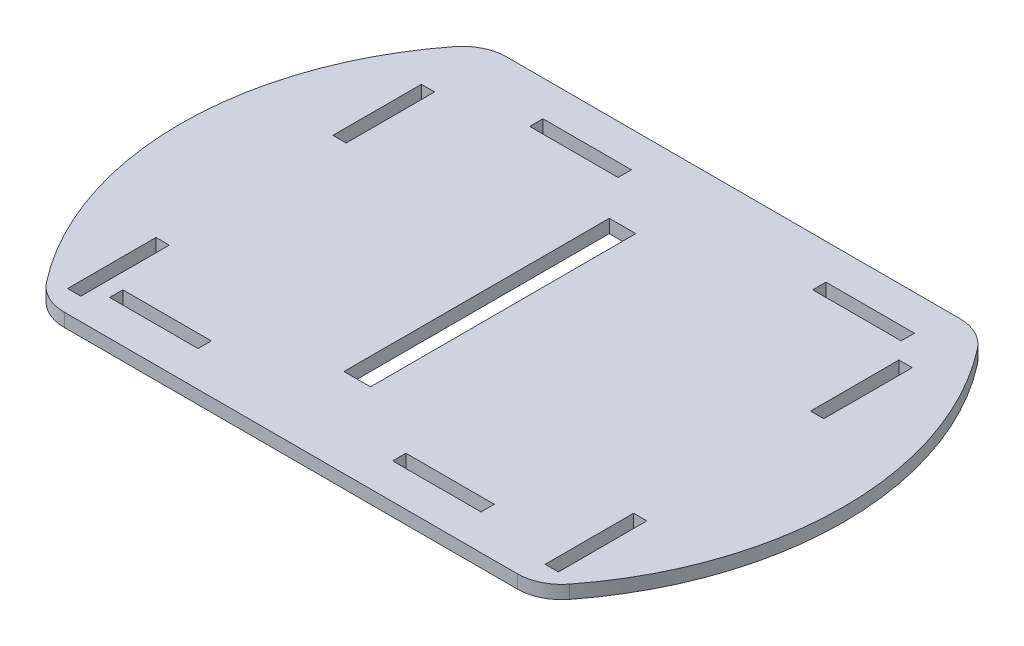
from build123d import *

# Parameters (mm, degrees)
BOSS_EXTRUDE1_DEPTH = 3
SKETCH2_W           = 3
SKETCH2_H           = 20
CUT_EXTRUDE1_DEPTH  = 10
SKETCH3_W           = 20
SKETCH3_H           = 3
CUT_EXTRUDE2_DEPTH  = 3
SKETCH4_W           = 120.041165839
SKETCH4_H           = 6
CUT_EXTRUDE3_DEPTH  = 3
SKETCH6_W           = 6
SKETCH6_H           = 60
CUT_EXTRUDE5_DEPTH  = 3
FILLET1_R           = 10


with BuildPart() as part:
    # Sketch1 → Boss-Extrude1 (new body)
    with BuildSketch(Plane(origin=(0, 0, 0), x_dir=(1, 0, 0), z_dir=(0, 1, 0))):
        with BuildLine():
            Line((-52.048054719, 54), (52.048054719, 54))
            ThreePointArc((52.048054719, 54), (66.679796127, 34.33372669), (74.188947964, 11))
            ThreePointArc((74.188947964, 11), (75, 0), (74.188947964, -11))
            ThreePointArc((74.188947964, -11), (66.679796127, -34.33372669), (52.048054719, -54))
            Line((52.048054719, -54), (-52.048054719, -54))
            ThreePointArc((-52.048054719, -54), (-66.679796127, -34.33372669), (-74.188947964, -11))
            ThreePointArc((-74.188947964, -11), (-75, 0), (-74.188947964, 11))
            ThreePointArc((-74.188947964, 11), (-66.679796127, 34.33372669), (-52.048054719, 54))
        make_face()
    extrude(amount=BOSS_EXTRUDE1_DEPTH)

    # Sketch2 → Cut-Extrude1 (cut)
    with BuildSketch(Plane(origin=(0, 3, 0), x_dir=(1, 0, 0), z_dir=(0, 1, 0))):
        with Locations((54, 25)):
            Rectangle(SKETCH2_W, SKETCH2_H)
        with Locations((54, -35)):
            Rectangle(SKETCH2_W, SKETCH2_H)
        with Locations((-54, -35)):
            Rectangle(SKETCH2_W, SKETCH2_H)
        with Locations((-54, 25)):
            Rectangle(SKETCH2_W, SKETCH2_H)
    extrude(amount=-CUT_EXTRUDE1_DEPTH, mode=Mode.SUBTRACT)

    # Sketch3 → Cut-Extrude2 (cut)
    with BuildSketch(Plane(origin=(0, 3, 0), x_dir=(1, 0, 0), z_dir=(0, 1, 0))):
        with Locations((-39, -40.5)):
            Rectangle(SKETCH3_W, SKETCH3_H)
        with Locations((25, -40.5)):
            Rectangle(SKETCH3_W, SKETCH3_H)
        with Locations((-25, 40.5)):
            Rectangle(SKETCH3_W, SKETCH3_H)
        with Locations((39, 40.5)):
            Rectangle(SKETCH3_W, SKETCH3_H)
    extrude(amount=-CUT_EXTRUDE2_DEPTH, mode=Mode.SUBTRACT)

    # Sketch4 → Cut-Extrude3 (cut)
    with BuildSketch(Plane(origin=(0, 3, 0), x_dir=(1, 0, 0), z_dir=(0, 1, 0))):
        with Locations((0.250675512, -53)):
            Rectangle(SKETCH4_W, SKETCH4_H)
        with Locations((0.250675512, 53)):
            Rectangle(SKETCH4_W, SKETCH4_H)
    extrude(amount=-CUT_EXTRUDE3_DEPTH, mode=Mode.SUBTRACT)

    # Sketch6 → Cut-Extrude5 (cut)
    with BuildSketch(Plane(origin=(0, 3, 0), x_dir=(1, 0, 0), z_dir=(0, 1, 0))):
        with Locations((-5, 0)):
            Rectangle(SKETCH6_W, SKETCH6_H)
    extrude(amount=-CUT_EXTRUDE5_DEPTH, mode=Mode.SUBTRACT)

    # Fillet1
    fillet1_edges = [part.edges().sort_by_distance(p)[0] for p in [
        (-55.901699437, 1.5, 50),
        (55.901699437, 1.5, 50),
        (-55.901699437, 1.5, -50),
        (55.901699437, 1.5, -50),
    ]]
    fillet(fillet1_edges, radius=FILLET1_R)


solid = part.part
